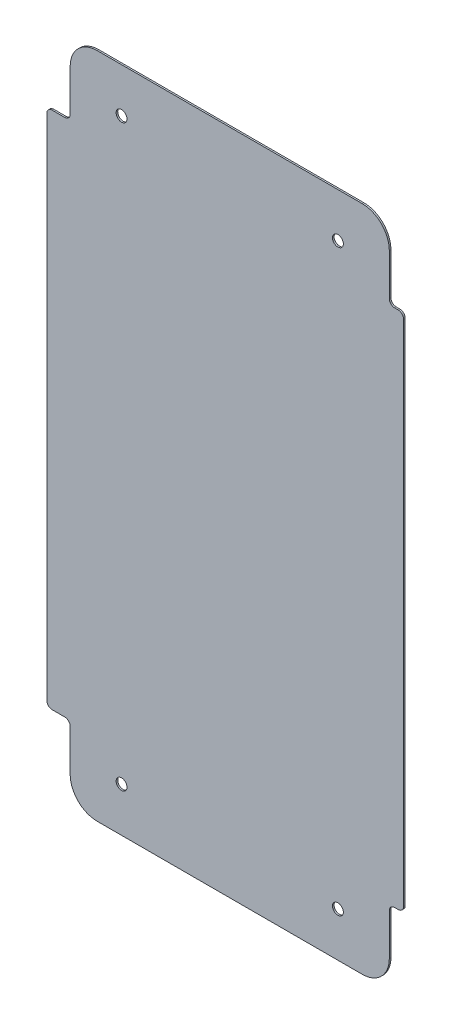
ISO-10303-21;
HEADER;
FILE_DESCRIPTION(('STEP AP214'),'2;1');
FILE_NAME('part.step','',(''),(''),'','','');
FILE_SCHEMA(('AUTOMOTIVE_DESIGN { 1 0 10303 214 1 1 1 1 }'));
ENDSEC;
DATA;
#1=APPLICATION_CONTEXT('core data for automotive mechanical design processes');
#2=APPLICATION_PROTOCOL_DEFINITION('international standard','automotive_design',2000,#1);
#3=PRODUCT_CONTEXT('',#1,'mechanical');
#4=PRODUCT('Part','Part','',(#3));
#5=PRODUCT_RELATED_PRODUCT_CATEGORY('part','',(#4));
#6=PRODUCT_DEFINITION_FORMATION('','',#4);
#7=PRODUCT_DEFINITION_CONTEXT('part definition',#1,'design');
#8=PRODUCT_DEFINITION('design','',#6,#7);
#9=PRODUCT_DEFINITION_SHAPE('','',#8);
#10=(LENGTH_UNIT() NAMED_UNIT(*) SI_UNIT(.MILLI.,.METRE.));
#11=(NAMED_UNIT(*) PLANE_ANGLE_UNIT() SI_UNIT($,.RADIAN.));
#12=(NAMED_UNIT(*) SI_UNIT($,.STERADIAN.) SOLID_ANGLE_UNIT());
#13=UNCERTAINTY_MEASURE_WITH_UNIT(LENGTH_MEASURE(1.E-05),#10,'distance_accuracy_value','');
#14=(GEOMETRIC_REPRESENTATION_CONTEXT(3) GLOBAL_UNCERTAINTY_ASSIGNED_CONTEXT((#13)) GLOBAL_UNIT_ASSIGNED_CONTEXT((#10,
#11,#12)) REPRESENTATION_CONTEXT('',''));
#15=CARTESIAN_POINT('',(0.,0.,0.));
#16=DIRECTION('',(0.,0.,1.));
#17=DIRECTION('',(1.,0.,0.));
#18=AXIS2_PLACEMENT_3D('',#15,#16,#17);
#19=CARTESIAN_POINT('',(81.661,121.92,0.762));
#20=DIRECTION('',(-1.,0.,0.));
#21=DIRECTION('',(0.,0.,1.));
#22=AXIS2_PLACEMENT_3D('',#19,#20,#21);
#23=PLANE('',#22);
#24=DIRECTION('',(0.,1.,0.));
#25=VECTOR('',#24,1.);
#26=CARTESIAN_POINT('',(81.661,121.92,0.762));
#27=LINE('',#26,#25);
#28=CARTESIAN_POINT('',(81.661,-119.38,0.762));
#29=VERTEX_POINT('',#28);
#30=CARTESIAN_POINT('',(81.661,119.38,0.762));
#31=VERTEX_POINT('',#30);
#32=EDGE_CURVE('E289',#29,#31,#27,.T.);
#33=ORIENTED_EDGE('',*,*,#32,.F.);
#34=DIRECTION('',(0.,0.,-1.));
#35=VECTOR('',#34,1.);
#36=CARTESIAN_POINT('',(81.661,-119.38,0.762));
#37=LINE('',#36,#35);
#38=CARTESIAN_POINT('',(81.661,-119.38,0.));
#39=VERTEX_POINT('',#38);
#40=EDGE_CURVE('E345',#29,#39,#37,.T.);
#41=ORIENTED_EDGE('',*,*,#40,.T.);
#42=DIRECTION('',(0.,1.,0.));
#43=VECTOR('',#42,1.);
#44=CARTESIAN_POINT('',(81.661,121.92,0.));
#45=LINE('',#44,#43);
#46=CARTESIAN_POINT('',(81.661,119.38,0.));
#47=VERTEX_POINT('',#46);
#48=EDGE_CURVE('E250',#39,#47,#45,.T.);
#49=ORIENTED_EDGE('',*,*,#48,.T.);
#50=DIRECTION('',(0.,0.,-1.));
#51=VECTOR('',#50,1.);
#52=CARTESIAN_POINT('',(81.661,119.38,0.762));
#53=LINE('',#52,#51);
#54=EDGE_CURVE('E343',#47,#31,#53,.F.);
#55=ORIENTED_EDGE('',*,*,#54,.T.);
#56=EDGE_LOOP('',(#33,#41,#49,#55));
#57=FACE_BOUND('',#56,.T.);
#58=ADVANCED_FACE('F32',(#57),#23,.F.);
#59=CARTESIAN_POINT('',(81.661,121.92,0.762));
#60=DIRECTION('',(0.,-1.,0.));
#61=DIRECTION('',(0.,0.,-1.));
#62=AXIS2_PLACEMENT_3D('',#59,#60,#61);
#63=PLANE('',#62);
#64=DIRECTION('',(-1.,0.,0.));
#65=VECTOR('',#64,1.);
#66=CARTESIAN_POINT('',(81.661,121.92,0.762));
#67=LINE('',#66,#65);
#68=CARTESIAN_POINT('',(79.121,121.92,0.762));
#69=VERTEX_POINT('',#68);
#70=CARTESIAN_POINT('',(77.4700000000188,121.92,0.762));
#71=VERTEX_POINT('',#70);
#72=EDGE_CURVE('E204',#69,#71,#67,.T.);
#73=ORIENTED_EDGE('',*,*,#72,.F.);
#74=DIRECTION('',(0.,0.,-1.));
#75=VECTOR('',#74,1.);
#76=CARTESIAN_POINT('',(79.121,121.92,0.762));
#77=LINE('',#76,#75);
#78=CARTESIAN_POINT('',(79.121,121.92,0.));
#79=VERTEX_POINT('',#78);
#80=EDGE_CURVE('E356',#69,#79,#77,.T.);
#81=ORIENTED_EDGE('',*,*,#80,.T.);
#82=DIRECTION('',(-1.,0.,0.));
#83=VECTOR('',#82,1.);
#84=CARTESIAN_POINT('',(81.661,121.92,0.));
#85=LINE('',#84,#83);
#86=CARTESIAN_POINT('',(77.4700000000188,121.92,0.));
#87=VERTEX_POINT('',#86);
#88=EDGE_CURVE('E253',#79,#87,#85,.T.);
#89=ORIENTED_EDGE('',*,*,#88,.T.);
#90=DIRECTION('',(0.,0.,-1.));
#91=VECTOR('',#90,1.);
#92=CARTESIAN_POINT('',(77.4700000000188,121.92,0.762));
#93=LINE('',#92,#91);
#94=EDGE_CURVE('E354',#87,#71,#93,.F.);
#95=ORIENTED_EDGE('',*,*,#94,.T.);
#96=EDGE_LOOP('',(#73,#81,#89,#95));
#97=FACE_BOUND('',#96,.T.);
#98=ADVANCED_FACE('F379',(#97),#63,.F.);
#99=CARTESIAN_POINT('',(74.9300000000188,144.018,0.762));
#100=DIRECTION('',(-1.,0.,0.));
#101=DIRECTION('',(0.,0.,1.));
#102=AXIS2_PLACEMENT_3D('',#99,#100,#101);
#103=PLANE('',#102);
#104=DIRECTION('',(0.,1.,0.));
#105=VECTOR('',#104,1.);
#106=CARTESIAN_POINT('',(74.9300000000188,144.018,0.762));
#107=LINE('',#106,#105);
#108=CARTESIAN_POINT('',(74.9300000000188,124.46,0.762));
#109=VERTEX_POINT('',#108);
#110=CARTESIAN_POINT('',(74.9300000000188,144.018,0.762));
#111=VERTEX_POINT('',#110);
#112=EDGE_CURVE('E192',#109,#111,#107,.T.);
#113=ORIENTED_EDGE('',*,*,#112,.F.);
#114=DIRECTION('',(0.,0.,-1.));
#115=VECTOR('',#114,1.);
#116=CARTESIAN_POINT('',(74.9300000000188,124.46,0.));
#117=LINE('',#116,#115);
#118=CARTESIAN_POINT('',(74.9300000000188,124.46,0.));
#119=VERTEX_POINT('',#118);
#120=EDGE_CURVE('E359',#109,#119,#117,.T.);
#121=ORIENTED_EDGE('',*,*,#120,.T.);
#122=DIRECTION('',(0.,1.,0.));
#123=VECTOR('',#122,1.);
#124=CARTESIAN_POINT('',(74.9300000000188,144.018,0.));
#125=LINE('',#124,#123);
#126=CARTESIAN_POINT('',(74.9300000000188,144.018,0.));
#127=VERTEX_POINT('',#126);
#128=EDGE_CURVE('E210',#119,#127,#125,.T.);
#129=ORIENTED_EDGE('',*,*,#128,.T.);
#130=DIRECTION('',(0.,0.,-1.));
#131=VECTOR('',#130,1.);
#132=CARTESIAN_POINT('',(74.9300000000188,144.018,0.762));
#133=LINE('',#132,#131);
#134=EDGE_CURVE('E207',#111,#127,#133,.T.);
#135=ORIENTED_EDGE('',*,*,#134,.F.);
#136=EDGE_LOOP('',(#113,#121,#129,#135));
#137=FACE_BOUND('',#136,.T.);
#138=ADVANCED_FACE('F208',(#137),#103,.F.);
#139=CARTESIAN_POINT('',(62.2300000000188,144.018,0.762));
#140=DIRECTION('',(0.,0.,-1.));
#141=DIRECTION('',(-1.,0.,0.));
#142=AXIS2_PLACEMENT_3D('',#139,#140,#141);
#143=CYLINDRICAL_SURFACE('',#142,12.7);
#144=CARTESIAN_POINT('',(62.2300000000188,144.018,0.));
#145=DIRECTION('',(0.,0.,1.));
#146=DIRECTION('',(-1.,0.,0.));
#147=AXIS2_PLACEMENT_3D('',#144,#145,#146);
#148=CIRCLE('',#147,12.7);
#149=CARTESIAN_POINT('',(62.2300000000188,156.718,0.));
#150=VERTEX_POINT('',#149);
#151=EDGE_CURVE('E258',#127,#150,#148,.T.);
#152=ORIENTED_EDGE('',*,*,#151,.T.);
#153=DIRECTION('',(0.,0.,-1.));
#154=VECTOR('',#153,1.);
#155=CARTESIAN_POINT('',(62.2300000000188,156.718,0.762));
#156=LINE('',#155,#154);
#157=CARTESIAN_POINT('',(62.2300000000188,156.718,0.762));
#158=VERTEX_POINT('',#157);
#159=EDGE_CURVE('E214',#158,#150,#156,.T.);
#160=ORIENTED_EDGE('',*,*,#159,.F.);
#161=CARTESIAN_POINT('',(62.2300000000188,144.018,0.762));
#162=DIRECTION('',(0.,0.,1.));
#163=DIRECTION('',(-1.,0.,0.));
#164=AXIS2_PLACEMENT_3D('',#161,#162,#163);
#165=CIRCLE('',#164,12.7);
#166=EDGE_CURVE('E197',#111,#158,#165,.T.);
#167=ORIENTED_EDGE('',*,*,#166,.F.);
#168=ORIENTED_EDGE('',*,*,#134,.T.);
#169=EDGE_LOOP('',(#152,#160,#167,#168));
#170=FACE_BOUND('',#169,.T.);
#171=ADVANCED_FACE('F216',(#170),#143,.T.);
#172=CARTESIAN_POINT('',(-62.2299999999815,156.718,0.762));
#173=DIRECTION('',(0.,-1.,0.));
#174=DIRECTION('',(0.,0.,-1.));
#175=AXIS2_PLACEMENT_3D('',#172,#173,#174);
#176=PLANE('',#175);
#177=DIRECTION('',(-1.,0.,0.));
#178=VECTOR('',#177,1.);
#179=CARTESIAN_POINT('',(-62.2299999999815,156.718,0.));
#180=LINE('',#179,#178);
#181=CARTESIAN_POINT('',(-62.2299999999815,156.718,0.));
#182=VERTEX_POINT('',#181);
#183=EDGE_CURVE('E260',#150,#182,#180,.T.);
#184=ORIENTED_EDGE('',*,*,#183,.T.);
#185=DIRECTION('',(0.,0.,-1.));
#186=VECTOR('',#185,1.);
#187=CARTESIAN_POINT('',(-62.2299999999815,156.718,0.762));
#188=LINE('',#187,#186);
#189=CARTESIAN_POINT('',(-62.2299999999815,156.718,0.762));
#190=VERTEX_POINT('',#189);
#191=EDGE_CURVE('E304',#190,#182,#188,.T.);
#192=ORIENTED_EDGE('',*,*,#191,.F.);
#193=DIRECTION('',(-1.,0.,0.));
#194=VECTOR('',#193,1.);
#195=CARTESIAN_POINT('',(-62.2299999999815,156.718,0.762));
#196=LINE('',#195,#194);
#197=EDGE_CURVE('E219',#158,#190,#196,.T.);
#198=ORIENTED_EDGE('',*,*,#197,.F.);
#199=ORIENTED_EDGE('',*,*,#159,.T.);
#200=EDGE_LOOP('',(#184,#192,#198,#199));
#201=FACE_BOUND('',#200,.T.);
#202=ADVANCED_FACE('F528',(#201),#176,.F.);
#203=CARTESIAN_POINT('',(-62.2299999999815,144.018,0.762));
#204=DIRECTION('',(0.,0.,-1.));
#205=DIRECTION('',(-1.,0.,0.));
#206=AXIS2_PLACEMENT_3D('',#203,#204,#205);
#207=CYLINDRICAL_SURFACE('',#206,12.7);
#208=CARTESIAN_POINT('',(-62.2299999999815,144.018,0.));
#209=DIRECTION('',(0.,0.,1.));
#210=DIRECTION('',(-1.,0.,0.));
#211=AXIS2_PLACEMENT_3D('',#208,#209,#210);
#212=CIRCLE('',#211,12.7);
#213=CARTESIAN_POINT('',(-74.9299999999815,144.018,0.));
#214=VERTEX_POINT('',#213);
#215=EDGE_CURVE('E262',#182,#214,#212,.T.);
#216=ORIENTED_EDGE('',*,*,#215,.T.);
#217=DIRECTION('',(0.,0.,-1.));
#218=VECTOR('',#217,1.);
#219=CARTESIAN_POINT('',(-74.9299999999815,144.018,0.762));
#220=LINE('',#219,#218);
#221=CARTESIAN_POINT('',(-74.9299999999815,144.018,0.762));
#222=VERTEX_POINT('',#221);
#223=EDGE_CURVE('E301',#222,#214,#220,.T.);
#224=ORIENTED_EDGE('',*,*,#223,.F.);
#225=CARTESIAN_POINT('',(-62.2299999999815,144.018,0.762));
#226=DIRECTION('',(0.,0.,1.));
#227=DIRECTION('',(-1.,0.,0.));
#228=AXIS2_PLACEMENT_3D('',#225,#226,#227);
#229=CIRCLE('',#228,12.7);
#230=EDGE_CURVE('E221',#190,#222,#229,.T.);
#231=ORIENTED_EDGE('',*,*,#230,.F.);
#232=ORIENTED_EDGE('',*,*,#191,.T.);
#233=EDGE_LOOP('',(#216,#224,#231,#232));
#234=FACE_BOUND('',#233,.T.);
#235=ADVANCED_FACE('F524',(#234),#207,.T.);
#236=CARTESIAN_POINT('',(-74.9299999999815,144.018,0.762));
#237=DIRECTION('',(1.,0.,0.));
#238=DIRECTION('',(0.,0.,-1.));
#239=AXIS2_PLACEMENT_3D('',#236,#237,#238);
#240=PLANE('',#239);
#241=DIRECTION('',(0.,-1.,0.));
#242=VECTOR('',#241,1.);
#243=CARTESIAN_POINT('',(-74.9299999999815,144.018,0.));
#244=LINE('',#243,#242);
#245=CARTESIAN_POINT('',(-74.9299999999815,124.46,0.));
#246=VERTEX_POINT('',#245);
#247=EDGE_CURVE('E264',#214,#246,#244,.T.);
#248=ORIENTED_EDGE('',*,*,#247,.T.);
#249=DIRECTION('',(0.,0.,-1.));
#250=VECTOR('',#249,1.);
#251=CARTESIAN_POINT('',(-74.9299999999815,124.46,0.762));
#252=LINE('',#251,#250);
#253=CARTESIAN_POINT('',(-74.9299999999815,124.46,0.762));
#254=VERTEX_POINT('',#253);
#255=EDGE_CURVE('E333',#246,#254,#252,.F.);
#256=ORIENTED_EDGE('',*,*,#255,.T.);
#257=DIRECTION('',(0.,-1.,0.));
#258=VECTOR('',#257,1.);
#259=CARTESIAN_POINT('',(-74.9299999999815,144.018,0.762));
#260=LINE('',#259,#258);
#261=EDGE_CURVE('E226',#222,#254,#260,.T.);
#262=ORIENTED_EDGE('',*,*,#261,.F.);
#263=ORIENTED_EDGE('',*,*,#223,.T.);
#264=EDGE_LOOP('',(#248,#256,#262,#263));
#265=FACE_BOUND('',#264,.T.);
#266=ADVANCED_FACE('F520',(#265),#240,.F.);
#267=CARTESIAN_POINT('',(-74.9299999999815,121.92,0.762));
#268=DIRECTION('',(0.,-1.,0.));
#269=DIRECTION('',(1.,0.,0.));
#270=AXIS2_PLACEMENT_3D('',#267,#268,#269);
#271=PLANE('',#270);
#272=DIRECTION('',(-1.,0.,0.));
#273=VECTOR('',#272,1.);
#274=CARTESIAN_POINT('',(-74.9299999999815,121.92,0.));
#275=LINE('',#274,#273);
#276=CARTESIAN_POINT('',(-77.4699999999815,121.92,0.));
#277=VERTEX_POINT('',#276);
#278=CARTESIAN_POINT('',(-83.3882,121.92,0.));
#279=VERTEX_POINT('',#278);
#280=EDGE_CURVE('E267',#277,#279,#275,.T.);
#281=ORIENTED_EDGE('',*,*,#280,.T.);
#282=DIRECTION('',(0.,0.,-1.));
#283=VECTOR('',#282,1.);
#284=CARTESIAN_POINT('',(-83.3882,121.92,0.762));
#285=LINE('',#284,#283);
#286=CARTESIAN_POINT('',(-83.3882,121.92,0.762));
#287=VERTEX_POINT('',#286);
#288=EDGE_CURVE('E323',#279,#287,#285,.F.);
#289=ORIENTED_EDGE('',*,*,#288,.T.);
#290=DIRECTION('',(-1.,0.,0.));
#291=VECTOR('',#290,1.);
#292=CARTESIAN_POINT('',(-74.9299999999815,121.92,0.762));
#293=LINE('',#292,#291);
#294=CARTESIAN_POINT('',(-77.4699999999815,121.92,0.762));
#295=VERTEX_POINT('',#294);
#296=EDGE_CURVE('E229',#295,#287,#293,.T.);
#297=ORIENTED_EDGE('',*,*,#296,.F.);
#298=DIRECTION('',(0.,0.,-1.));
#299=VECTOR('',#298,1.);
#300=CARTESIAN_POINT('',(-77.4699999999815,121.92,0.));
#301=LINE('',#300,#299);
#302=EDGE_CURVE('E320',#295,#277,#301,.T.);
#303=ORIENTED_EDGE('',*,*,#302,.T.);
#304=EDGE_LOOP('',(#281,#289,#297,#303));
#305=FACE_BOUND('',#304,.T.);
#306=ADVANCED_FACE('F516',(#305),#271,.F.);
#307=CARTESIAN_POINT('',(-85.9282,121.92,0.762));
#308=DIRECTION('',(1.,0.,0.));
#309=DIRECTION('',(0.,0.,-1.));
#310=AXIS2_PLACEMENT_3D('',#307,#308,#309);
#311=PLANE('',#310);
#312=DIRECTION('',(0.,-1.,0.));
#313=VECTOR('',#312,1.);
#314=CARTESIAN_POINT('',(-85.9282,121.92,0.762));
#315=LINE('',#314,#313);
#316=CARTESIAN_POINT('',(-85.9282,119.38,0.762));
#317=VERTEX_POINT('',#316);
#318=CARTESIAN_POINT('',(-85.9282,-119.38,0.762));
#319=VERTEX_POINT('',#318);
#320=EDGE_CURVE('E231',#317,#319,#315,.T.);
#321=ORIENTED_EDGE('',*,*,#320,.F.);
#322=DIRECTION('',(0.,0.,-1.));
#323=VECTOR('',#322,1.);
#324=CARTESIAN_POINT('',(-85.9282,119.38,0.762));
#325=LINE('',#324,#323);
#326=CARTESIAN_POINT('',(-85.9282,119.38,0.));
#327=VERTEX_POINT('',#326);
#328=EDGE_CURVE('E309',#317,#327,#325,.T.);
#329=ORIENTED_EDGE('',*,*,#328,.T.);
#330=DIRECTION('',(0.,-1.,0.));
#331=VECTOR('',#330,1.);
#332=CARTESIAN_POINT('',(-85.9282,121.92,0.));
#333=LINE('',#332,#331);
#334=CARTESIAN_POINT('',(-85.9282,-119.38,0.));
#335=VERTEX_POINT('',#334);
#336=EDGE_CURVE('E270',#327,#335,#333,.T.);
#337=ORIENTED_EDGE('',*,*,#336,.T.);
#338=DIRECTION('',(0.,0.,-1.));
#339=VECTOR('',#338,1.);
#340=CARTESIAN_POINT('',(-85.9282,-119.38,0.762));
#341=LINE('',#340,#339);
#342=EDGE_CURVE('E213',#335,#319,#341,.F.);
#343=ORIENTED_EDGE('',*,*,#342,.T.);
#344=EDGE_LOOP('',(#321,#329,#337,#343));
#345=FACE_BOUND('',#344,.T.);
#346=ADVANCED_FACE('F512',(#345),#311,.F.);
#347=CARTESIAN_POINT('',(-74.9299999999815,-121.92,0.762));
#348=DIRECTION('',(0.,1.,0.));
#349=DIRECTION('',(0.,0.,1.));
#350=AXIS2_PLACEMENT_3D('',#347,#348,#349);
#351=PLANE('',#350);
#352=DIRECTION('',(1.,0.,0.));
#353=VECTOR('',#352,1.);
#354=CARTESIAN_POINT('',(-74.9299999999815,-121.92,0.762));
#355=LINE('',#354,#353);
#356=CARTESIAN_POINT('',(-83.3882,-121.92,0.762));
#357=VERTEX_POINT('',#356);
#358=CARTESIAN_POINT('',(-77.4699999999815,-121.92,0.762));
#359=VERTEX_POINT('',#358);
#360=EDGE_CURVE('E234',#357,#359,#355,.T.);
#361=ORIENTED_EDGE('',*,*,#360,.F.);
#362=DIRECTION('',(0.,0.,-1.));
#363=VECTOR('',#362,1.);
#364=CARTESIAN_POINT('',(-83.3882,-121.92,0.762));
#365=LINE('',#364,#363);
#366=CARTESIAN_POINT('',(-83.3882,-121.92,0.));
#367=VERTEX_POINT('',#366);
#368=EDGE_CURVE('E337',#357,#367,#365,.T.);
#369=ORIENTED_EDGE('',*,*,#368,.T.);
#370=DIRECTION('',(1.,0.,0.));
#371=VECTOR('',#370,1.);
#372=CARTESIAN_POINT('',(-74.9299999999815,-121.92,0.));
#373=LINE('',#372,#371);
#374=CARTESIAN_POINT('',(-77.4699999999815,-121.92,0.));
#375=VERTEX_POINT('',#374);
#376=EDGE_CURVE('E273',#367,#375,#373,.T.);
#377=ORIENTED_EDGE('',*,*,#376,.T.);
#378=DIRECTION('',(0.,0.,-1.));
#379=VECTOR('',#378,1.);
#380=CARTESIAN_POINT('',(-77.4699999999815,-121.92,0.762));
#381=LINE('',#380,#379);
#382=EDGE_CURVE('E335',#375,#359,#381,.F.);
#383=ORIENTED_EDGE('',*,*,#382,.T.);
#384=EDGE_LOOP('',(#361,#369,#377,#383));
#385=FACE_BOUND('',#384,.T.);
#386=ADVANCED_FACE('F508',(#385),#351,.F.);
#387=CARTESIAN_POINT('',(-74.9299999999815,-121.92,0.762));
#388=DIRECTION('',(1.,0.,0.));
#389=DIRECTION('',(0.,0.,-1.));
#390=AXIS2_PLACEMENT_3D('',#387,#388,#389);
#391=PLANE('',#390);
#392=DIRECTION('',(0.,-1.,0.));
#393=VECTOR('',#392,1.);
#394=CARTESIAN_POINT('',(-74.9299999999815,-121.92,0.762));
#395=LINE('',#394,#393);
#396=CARTESIAN_POINT('',(-74.9299999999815,-124.46,0.762));
#397=VERTEX_POINT('',#396);
#398=CARTESIAN_POINT('',(-74.9299999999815,-144.018,0.762));
#399=VERTEX_POINT('',#398);
#400=EDGE_CURVE('E237',#397,#399,#395,.T.);
#401=ORIENTED_EDGE('',*,*,#400,.F.);
#402=DIRECTION('',(0.,0.,-1.));
#403=VECTOR('',#402,1.);
#404=CARTESIAN_POINT('',(-74.9299999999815,-124.46,0.));
#405=LINE('',#404,#403);
#406=CARTESIAN_POINT('',(-74.9299999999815,-124.46,0.));
#407=VERTEX_POINT('',#406);
#408=EDGE_CURVE('E340',#397,#407,#405,.T.);
#409=ORIENTED_EDGE('',*,*,#408,.T.);
#410=DIRECTION('',(0.,-1.,0.));
#411=VECTOR('',#410,1.);
#412=CARTESIAN_POINT('',(-74.9299999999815,-121.92,0.));
#413=LINE('',#412,#411);
#414=CARTESIAN_POINT('',(-74.9299999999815,-144.018,0.));
#415=VERTEX_POINT('',#414);
#416=EDGE_CURVE('E276',#407,#415,#413,.T.);
#417=ORIENTED_EDGE('',*,*,#416,.T.);
#418=DIRECTION('',(0.,0.,-1.));
#419=VECTOR('',#418,1.);
#420=CARTESIAN_POINT('',(-74.9299999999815,-144.018,0.762));
#421=LINE('',#420,#419);
#422=EDGE_CURVE('E298',#399,#415,#421,.T.);
#423=ORIENTED_EDGE('',*,*,#422,.F.);
#424=EDGE_LOOP('',(#401,#409,#417,#423));
#425=FACE_BOUND('',#424,.T.);
#426=ADVANCED_FACE('F504',(#425),#391,.F.);
#427=CARTESIAN_POINT('',(-62.2299999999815,-144.018,0.762));
#428=DIRECTION('',(0.,0.,-1.));
#429=DIRECTION('',(-1.,0.,0.));
#430=AXIS2_PLACEMENT_3D('',#427,#428,#429);
#431=CYLINDRICAL_SURFACE('',#430,12.7);
#432=CARTESIAN_POINT('',(-62.2299999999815,-144.018,0.));
#433=DIRECTION('',(0.,0.,1.));
#434=DIRECTION('',(1.,0.,0.));
#435=AXIS2_PLACEMENT_3D('',#432,#433,#434);
#436=CIRCLE('',#435,12.7);
#437=CARTESIAN_POINT('',(-62.2299999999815,-156.718,0.));
#438=VERTEX_POINT('',#437);
#439=EDGE_CURVE('E278',#415,#438,#436,.T.);
#440=ORIENTED_EDGE('',*,*,#439,.T.);
#441=DIRECTION('',(0.,0.,-1.));
#442=VECTOR('',#441,1.);
#443=CARTESIAN_POINT('',(-62.2299999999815,-156.718,0.762));
#444=LINE('',#443,#442);
#445=CARTESIAN_POINT('',(-62.2299999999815,-156.718,0.762));
#446=VERTEX_POINT('',#445);
#447=EDGE_CURVE('E295',#446,#438,#444,.T.);
#448=ORIENTED_EDGE('',*,*,#447,.F.);
#449=CARTESIAN_POINT('',(-62.2299999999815,-144.018,0.762));
#450=DIRECTION('',(0.,0.,1.));
#451=DIRECTION('',(1.,0.,0.));
#452=AXIS2_PLACEMENT_3D('',#449,#450,#451);
#453=CIRCLE('',#452,12.7);
#454=EDGE_CURVE('E239',#399,#446,#453,.T.);
#455=ORIENTED_EDGE('',*,*,#454,.F.);
#456=ORIENTED_EDGE('',*,*,#422,.T.);
#457=EDGE_LOOP('',(#440,#448,#455,#456));
#458=FACE_BOUND('',#457,.T.);
#459=ADVANCED_FACE('F500',(#458),#431,.T.);
#460=CARTESIAN_POINT('',(-62.2299999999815,-156.718,0.762));
#461=DIRECTION('',(0.,1.,0.));
#462=DIRECTION('',(0.,0.,1.));
#463=AXIS2_PLACEMENT_3D('',#460,#461,#462);
#464=PLANE('',#463);
#465=DIRECTION('',(1.,0.,0.));
#466=VECTOR('',#465,1.);
#467=CARTESIAN_POINT('',(-62.2299999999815,-156.718,0.));
#468=LINE('',#467,#466);
#469=CARTESIAN_POINT('',(62.2300000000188,-156.718,0.));
#470=VERTEX_POINT('',#469);
#471=EDGE_CURVE('E280',#438,#470,#468,.T.);
#472=ORIENTED_EDGE('',*,*,#471,.T.);
#473=DIRECTION('',(0.,0.,-1.));
#474=VECTOR('',#473,1.);
#475=CARTESIAN_POINT('',(62.2300000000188,-156.718,0.762));
#476=LINE('',#475,#474);
#477=CARTESIAN_POINT('',(62.2300000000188,-156.718,0.762));
#478=VERTEX_POINT('',#477);
#479=EDGE_CURVE('E292',#478,#470,#476,.T.);
#480=ORIENTED_EDGE('',*,*,#479,.F.);
#481=DIRECTION('',(1.,0.,0.));
#482=VECTOR('',#481,1.);
#483=CARTESIAN_POINT('',(-62.2299999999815,-156.718,0.762));
#484=LINE('',#483,#482);
#485=EDGE_CURVE('E241',#446,#478,#484,.T.);
#486=ORIENTED_EDGE('',*,*,#485,.F.);
#487=ORIENTED_EDGE('',*,*,#447,.T.);
#488=EDGE_LOOP('',(#472,#480,#486,#487));
#489=FACE_BOUND('',#488,.T.);
#490=ADVANCED_FACE('F496',(#489),#464,.F.);
#491=CARTESIAN_POINT('',(62.2300000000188,-144.018,0.762));
#492=DIRECTION('',(0.,0.,-1.));
#493=DIRECTION('',(-1.,0.,0.));
#494=AXIS2_PLACEMENT_3D('',#491,#492,#493);
#495=CYLINDRICAL_SURFACE('',#494,12.7);
#496=CARTESIAN_POINT('',(62.2300000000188,-144.018,0.));
#497=DIRECTION('',(0.,0.,1.));
#498=DIRECTION('',(1.,0.,0.));
#499=AXIS2_PLACEMENT_3D('',#496,#497,#498);
#500=CIRCLE('',#499,12.7);
#501=CARTESIAN_POINT('',(74.9300000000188,-144.018,0.));
#502=VERTEX_POINT('',#501);
#503=EDGE_CURVE('E282',#470,#502,#500,.T.);
#504=ORIENTED_EDGE('',*,*,#503,.T.);
#505=DIRECTION('',(0.,0.,-1.));
#506=VECTOR('',#505,1.);
#507=CARTESIAN_POINT('',(74.9300000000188,-144.018,0.762));
#508=LINE('',#507,#506);
#509=CARTESIAN_POINT('',(74.9300000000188,-144.018,0.762));
#510=VERTEX_POINT('',#509);
#511=EDGE_CURVE('E249',#510,#502,#508,.T.);
#512=ORIENTED_EDGE('',*,*,#511,.F.);
#513=CARTESIAN_POINT('',(62.2300000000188,-144.018,0.762));
#514=DIRECTION('',(0.,0.,1.));
#515=DIRECTION('',(1.,0.,0.));
#516=AXIS2_PLACEMENT_3D('',#513,#514,#515);
#517=CIRCLE('',#516,12.7);
#518=EDGE_CURVE('E243',#478,#510,#517,.T.);
#519=ORIENTED_EDGE('',*,*,#518,.F.);
#520=ORIENTED_EDGE('',*,*,#479,.T.);
#521=EDGE_LOOP('',(#504,#512,#519,#520));
#522=FACE_BOUND('',#521,.T.);
#523=ADVANCED_FACE('F492',(#522),#495,.T.);
#524=CARTESIAN_POINT('',(74.9300000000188,-121.92,0.762));
#525=DIRECTION('',(-1.,0.,0.));
#526=DIRECTION('',(0.,0.,1.));
#527=AXIS2_PLACEMENT_3D('',#524,#525,#526);
#528=PLANE('',#527);
#529=DIRECTION('',(0.,1.,0.));
#530=VECTOR('',#529,1.);
#531=CARTESIAN_POINT('',(74.9300000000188,-121.92,0.));
#532=LINE('',#531,#530);
#533=CARTESIAN_POINT('',(74.9300000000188,-124.46,0.));
#534=VERTEX_POINT('',#533);
#535=EDGE_CURVE('E284',#502,#534,#532,.T.);
#536=ORIENTED_EDGE('',*,*,#535,.T.);
#537=DIRECTION('',(0.,0.,-1.));
#538=VECTOR('',#537,1.);
#539=CARTESIAN_POINT('',(74.9300000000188,-124.46,0.762));
#540=LINE('',#539,#538);
#541=CARTESIAN_POINT('',(74.9300000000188,-124.46,0.762));
#542=VERTEX_POINT('',#541);
#543=EDGE_CURVE('E352',#534,#542,#540,.F.);
#544=ORIENTED_EDGE('',*,*,#543,.T.);
#545=DIRECTION('',(0.,1.,0.));
#546=VECTOR('',#545,1.);
#547=CARTESIAN_POINT('',(74.9300000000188,-121.92,0.762));
#548=LINE('',#547,#546);
#549=EDGE_CURVE('E245',#510,#542,#548,.T.);
#550=ORIENTED_EDGE('',*,*,#549,.F.);
#551=ORIENTED_EDGE('',*,*,#511,.T.);
#552=EDGE_LOOP('',(#536,#544,#550,#551));
#553=FACE_BOUND('',#552,.T.);
#554=ADVANCED_FACE('F489',(#553),#528,.F.);
#555=CARTESIAN_POINT('',(81.661,-121.92,0.762));
#556=DIRECTION('',(0.,1.,0.));
#557=DIRECTION('',(0.,0.,1.));
#558=AXIS2_PLACEMENT_3D('',#555,#556,#557);
#559=PLANE('',#558);
#560=DIRECTION('',(1.,0.,0.));
#561=VECTOR('',#560,1.);
#562=CARTESIAN_POINT('',(81.661,-121.92,0.));
#563=LINE('',#562,#561);
#564=CARTESIAN_POINT('',(77.4700000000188,-121.92,0.));
#565=VERTEX_POINT('',#564);
#566=CARTESIAN_POINT('',(79.121,-121.92,0.));
#567=VERTEX_POINT('',#566);
#568=EDGE_CURVE('E287',#565,#567,#563,.T.);
#569=ORIENTED_EDGE('',*,*,#568,.T.);
#570=DIRECTION('',(0.,0.,-1.));
#571=VECTOR('',#570,1.);
#572=CARTESIAN_POINT('',(79.121,-121.92,0.762));
#573=LINE('',#572,#571);
#574=CARTESIAN_POINT('',(79.121,-121.92,0.762));
#575=VERTEX_POINT('',#574);
#576=EDGE_CURVE('E47',#567,#575,#573,.F.);
#577=ORIENTED_EDGE('',*,*,#576,.T.);
#578=DIRECTION('',(1.,0.,0.));
#579=VECTOR('',#578,1.);
#580=CARTESIAN_POINT('',(81.661,-121.92,0.762));
#581=LINE('',#580,#579);
#582=CARTESIAN_POINT('',(77.4700000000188,-121.92,0.762));
#583=VERTEX_POINT('',#582);
#584=EDGE_CURVE('E247',#583,#575,#581,.T.);
#585=ORIENTED_EDGE('',*,*,#584,.F.);
#586=DIRECTION('',(0.,0.,-1.));
#587=VECTOR('',#586,1.);
#588=CARTESIAN_POINT('',(77.4700000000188,-121.92,0.));
#589=LINE('',#588,#587);
#590=EDGE_CURVE('E348',#583,#565,#589,.T.);
#591=ORIENTED_EDGE('',*,*,#590,.T.);
#592=EDGE_LOOP('',(#569,#577,#585,#591));
#593=FACE_BOUND('',#592,.T.);
#594=ADVANCED_FACE('F426',(#593),#559,.F.);
#595=CARTESIAN_POINT('',(62.2300000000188,-144.018,0.762));
#596=DIRECTION('',(0.,0.,1.));
#597=DIRECTION('',(1.,0.,0.));
#598=AXIS2_PLACEMENT_3D('',#595,#596,#597);
#599=PLANE('',#598);
#600=CARTESIAN_POINT('',(50.8,135.89,0.762));
#601=DIRECTION('',(0.,0.,-1.));
#602=DIRECTION('',(-1.,0.,0.));
#603=AXIS2_PLACEMENT_3D('',#600,#601,#602);
#604=CIRCLE('',#603,2.5527);
#605=CARTESIAN_POINT('',(48.2473,135.89,0.762));
#606=VERTEX_POINT('',#605);
#607=EDGE_CURVE('E453',#606,#606,#604,.T.);
#608=ORIENTED_EDGE('',*,*,#607,.T.);
#609=EDGE_LOOP('',(#608));
#610=FACE_BOUND('',#609,.T.);
#611=CARTESIAN_POINT('',(-50.8,135.89,0.762));
#612=DIRECTION('',(0.,0.,-1.));
#613=DIRECTION('',(-1.,0.,0.));
#614=AXIS2_PLACEMENT_3D('',#611,#612,#613);
#615=CIRCLE('',#614,2.5527);
#616=CARTESIAN_POINT('',(-53.3527,135.89,0.762));
#617=VERTEX_POINT('',#616);
#618=EDGE_CURVE('E447',#617,#617,#615,.T.);
#619=ORIENTED_EDGE('',*,*,#618,.T.);
#620=EDGE_LOOP('',(#619));
#621=FACE_BOUND('',#620,.T.);
#622=CARTESIAN_POINT('',(-50.8,-135.89,0.762));
#623=DIRECTION('',(0.,0.,-1.));
#624=DIRECTION('',(-1.,0.,0.));
#625=AXIS2_PLACEMENT_3D('',#622,#623,#624);
#626=CIRCLE('',#625,2.5527);
#627=CARTESIAN_POINT('',(-53.3527,-135.89,0.762));
#628=VERTEX_POINT('',#627);
#629=EDGE_CURVE('E441',#628,#628,#626,.T.);
#630=ORIENTED_EDGE('',*,*,#629,.T.);
#631=EDGE_LOOP('',(#630));
#632=FACE_BOUND('',#631,.T.);
#633=CARTESIAN_POINT('',(50.8,-135.89,0.762));
#634=DIRECTION('',(0.,0.,-1.));
#635=DIRECTION('',(-1.,0.,0.));
#636=AXIS2_PLACEMENT_3D('',#633,#634,#635);
#637=CIRCLE('',#636,2.5527);
#638=CARTESIAN_POINT('',(48.2473,-135.89,0.762));
#639=VERTEX_POINT('',#638);
#640=EDGE_CURVE('E254',#639,#639,#637,.T.);
#641=ORIENTED_EDGE('',*,*,#640,.T.);
#642=EDGE_LOOP('',(#641));
#643=FACE_BOUND('',#642,.T.);
#644=ORIENTED_EDGE('',*,*,#296,.T.);
#645=CARTESIAN_POINT('',(-83.3882,119.38,0.762));
#646=DIRECTION('',(0.,0.,1.));
#647=DIRECTION('',(1.,0.,0.));
#648=AXIS2_PLACEMENT_3D('',#645,#646,#647);
#649=CIRCLE('',#648,2.54);
#650=EDGE_CURVE('E331',#287,#317,#649,.T.);
#651=ORIENTED_EDGE('',*,*,#650,.T.);
#652=ORIENTED_EDGE('',*,*,#320,.T.);
#653=CARTESIAN_POINT('',(-83.3882,-119.38,0.762));
#654=DIRECTION('',(0.,0.,1.));
#655=DIRECTION('',(1.,0.,0.));
#656=AXIS2_PLACEMENT_3D('',#653,#654,#655);
#657=CIRCLE('',#656,2.54);
#658=EDGE_CURVE('E329',#319,#357,#657,.T.);
#659=ORIENTED_EDGE('',*,*,#658,.T.);
#660=ORIENTED_EDGE('',*,*,#360,.T.);
#661=CARTESIAN_POINT('',(-77.4699999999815,-124.46,0.762));
#662=DIRECTION('',(0.,0.,1.));
#663=DIRECTION('',(1.,0.,0.));
#664=AXIS2_PLACEMENT_3D('',#661,#662,#663);
#665=CIRCLE('',#664,2.54);
#666=EDGE_CURVE('E367',#359,#397,#665,.F.);
#667=ORIENTED_EDGE('',*,*,#666,.T.);
#668=ORIENTED_EDGE('',*,*,#400,.T.);
#669=ORIENTED_EDGE('',*,*,#454,.T.);
#670=ORIENTED_EDGE('',*,*,#485,.T.);
#671=ORIENTED_EDGE('',*,*,#518,.T.);
#672=ORIENTED_EDGE('',*,*,#549,.T.);
#673=CARTESIAN_POINT('',(77.4700000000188,-124.46,0.762));
#674=DIRECTION('',(0.,0.,1.));
#675=DIRECTION('',(1.,0.,0.));
#676=AXIS2_PLACEMENT_3D('',#673,#674,#675);
#677=CIRCLE('',#676,2.54);
#678=EDGE_CURVE('E54',#542,#583,#677,.F.);
#679=ORIENTED_EDGE('',*,*,#678,.T.);
#680=ORIENTED_EDGE('',*,*,#584,.T.);
#681=CARTESIAN_POINT('',(79.121,-119.38,0.762));
#682=DIRECTION('',(0.,0.,1.));
#683=DIRECTION('',(1.,0.,0.));
#684=AXIS2_PLACEMENT_3D('',#681,#682,#683);
#685=CIRCLE('',#684,2.54);
#686=EDGE_CURVE('E327',#575,#29,#685,.T.);
#687=ORIENTED_EDGE('',*,*,#686,.T.);
#688=ORIENTED_EDGE('',*,*,#32,.T.);
#689=CARTESIAN_POINT('',(79.121,119.38,0.762));
#690=DIRECTION('',(0.,0.,1.));
#691=DIRECTION('',(1.,0.,0.));
#692=AXIS2_PLACEMENT_3D('',#689,#690,#691);
#693=CIRCLE('',#692,2.54);
#694=EDGE_CURVE('E325',#31,#69,#693,.T.);
#695=ORIENTED_EDGE('',*,*,#694,.T.);
#696=ORIENTED_EDGE('',*,*,#72,.T.);
#697=CARTESIAN_POINT('',(77.4700000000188,124.46,0.762));
#698=DIRECTION('',(0.,0.,1.));
#699=DIRECTION('',(1.,0.,0.));
#700=AXIS2_PLACEMENT_3D('',#697,#698,#699);
#701=CIRCLE('',#700,2.54);
#702=EDGE_CURVE('E11',#71,#109,#701,.F.);
#703=ORIENTED_EDGE('',*,*,#702,.T.);
#704=ORIENTED_EDGE('',*,*,#112,.T.);
#705=ORIENTED_EDGE('',*,*,#166,.T.);
#706=ORIENTED_EDGE('',*,*,#197,.T.);
#707=ORIENTED_EDGE('',*,*,#230,.T.);
#708=ORIENTED_EDGE('',*,*,#261,.T.);
#709=CARTESIAN_POINT('',(-77.4699999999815,124.46,0.762));
#710=DIRECTION('',(0.,0.,1.));
#711=DIRECTION('',(1.,0.,0.));
#712=AXIS2_PLACEMENT_3D('',#709,#710,#711);
#713=CIRCLE('',#712,2.54);
#714=EDGE_CURVE('E363',#254,#295,#713,.F.);
#715=ORIENTED_EDGE('',*,*,#714,.T.);
#716=EDGE_LOOP('',(#644,#651,#652,#659,#660,#667,#668,#669,#670,#671,#672,#679,#680,#687,#688,
#695,#696,#703,#704,#705,#706,#707,#708,#715));
#717=FACE_BOUND('',#716,.T.);
#718=ADVANCED_FACE('F195',(#610,#621,#632,#643,#717),#599,.T.);
#719=CARTESIAN_POINT('',(62.2300000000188,-144.018,0.));
#720=DIRECTION('',(0.,0.,1.));
#721=DIRECTION('',(1.,0.,0.));
#722=AXIS2_PLACEMENT_3D('',#719,#720,#721);
#723=PLANE('',#722);
#724=CARTESIAN_POINT('',(50.8,135.89,0.));
#725=DIRECTION('',(0.,0.,-1.));
#726=DIRECTION('',(-1.,0.,0.));
#727=AXIS2_PLACEMENT_3D('',#724,#725,#726);
#728=CIRCLE('',#727,2.55269999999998);
#729=CARTESIAN_POINT('',(48.2473,135.89,0.));
#730=VERTEX_POINT('',#729);
#731=EDGE_CURVE('E456',#730,#730,#728,.T.);
#732=ORIENTED_EDGE('',*,*,#731,.F.);
#733=EDGE_LOOP('',(#732));
#734=FACE_BOUND('',#733,.T.);
#735=CARTESIAN_POINT('',(-50.8,135.89,0.));
#736=DIRECTION('',(0.,0.,-1.));
#737=DIRECTION('',(-1.,0.,0.));
#738=AXIS2_PLACEMENT_3D('',#735,#736,#737);
#739=CIRCLE('',#738,2.55269999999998);
#740=CARTESIAN_POINT('',(-53.3527,135.89,0.));
#741=VERTEX_POINT('',#740);
#742=EDGE_CURVE('E450',#741,#741,#739,.T.);
#743=ORIENTED_EDGE('',*,*,#742,.F.);
#744=EDGE_LOOP('',(#743));
#745=FACE_BOUND('',#744,.T.);
#746=CARTESIAN_POINT('',(-50.8,-135.89,0.));
#747=DIRECTION('',(0.,0.,-1.));
#748=DIRECTION('',(-1.,0.,0.));
#749=AXIS2_PLACEMENT_3D('',#746,#747,#748);
#750=CIRCLE('',#749,2.55269999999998);
#751=CARTESIAN_POINT('',(-53.3527,-135.89,0.));
#752=VERTEX_POINT('',#751);
#753=EDGE_CURVE('E444',#752,#752,#750,.T.);
#754=ORIENTED_EDGE('',*,*,#753,.F.);
#755=EDGE_LOOP('',(#754));
#756=FACE_BOUND('',#755,.T.);
#757=CARTESIAN_POINT('',(50.8,-135.89,0.));
#758=DIRECTION('',(0.,0.,-1.));
#759=DIRECTION('',(-1.,0.,0.));
#760=AXIS2_PLACEMENT_3D('',#757,#758,#759);
#761=CIRCLE('',#760,2.55269999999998);
#762=CARTESIAN_POINT('',(48.2473,-135.89,0.));
#763=VERTEX_POINT('',#762);
#764=EDGE_CURVE('E438',#763,#763,#761,.T.);
#765=ORIENTED_EDGE('',*,*,#764,.F.);
#766=EDGE_LOOP('',(#765));
#767=FACE_BOUND('',#766,.T.);
#768=ORIENTED_EDGE('',*,*,#336,.F.);
#769=CARTESIAN_POINT('',(-83.3882,119.38,0.));
#770=DIRECTION('',(0.,0.,1.));
#771=DIRECTION('',(1.,0.,0.));
#772=AXIS2_PLACEMENT_3D('',#769,#770,#771);
#773=CIRCLE('',#772,2.54);
#774=EDGE_CURVE('E318',#327,#279,#773,.F.);
#775=ORIENTED_EDGE('',*,*,#774,.T.);
#776=ORIENTED_EDGE('',*,*,#280,.F.);
#777=CARTESIAN_POINT('',(-77.4699999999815,124.46,0.));
#778=DIRECTION('',(0.,0.,1.));
#779=DIRECTION('',(1.,0.,0.));
#780=AXIS2_PLACEMENT_3D('',#777,#778,#779);
#781=CIRCLE('',#780,2.54);
#782=EDGE_CURVE('E361',#277,#246,#781,.T.);
#783=ORIENTED_EDGE('',*,*,#782,.T.);
#784=ORIENTED_EDGE('',*,*,#247,.F.);
#785=ORIENTED_EDGE('',*,*,#215,.F.);
#786=ORIENTED_EDGE('',*,*,#183,.F.);
#787=ORIENTED_EDGE('',*,*,#151,.F.);
#788=ORIENTED_EDGE('',*,*,#128,.F.);
#789=CARTESIAN_POINT('',(77.4700000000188,124.46,0.));
#790=DIRECTION('',(0.,0.,1.));
#791=DIRECTION('',(1.,0.,0.));
#792=AXIS2_PLACEMENT_3D('',#789,#790,#791);
#793=CIRCLE('',#792,2.54);
#794=EDGE_CURVE('E40',#119,#87,#793,.T.);
#795=ORIENTED_EDGE('',*,*,#794,.T.);
#796=ORIENTED_EDGE('',*,*,#88,.F.);
#797=CARTESIAN_POINT('',(79.121,119.38,0.));
#798=DIRECTION('',(0.,0.,1.));
#799=DIRECTION('',(1.,0.,0.));
#800=AXIS2_PLACEMENT_3D('',#797,#798,#799);
#801=CIRCLE('',#800,2.54);
#802=EDGE_CURVE('E312',#79,#47,#801,.F.);
#803=ORIENTED_EDGE('',*,*,#802,.T.);
#804=ORIENTED_EDGE('',*,*,#48,.F.);
#805=CARTESIAN_POINT('',(79.121,-119.38,0.));
#806=DIRECTION('',(0.,0.,1.));
#807=DIRECTION('',(1.,0.,0.));
#808=AXIS2_PLACEMENT_3D('',#805,#806,#807);
#809=CIRCLE('',#808,2.54);
#810=EDGE_CURVE('E314',#39,#567,#809,.F.);
#811=ORIENTED_EDGE('',*,*,#810,.T.);
#812=ORIENTED_EDGE('',*,*,#568,.F.);
#813=CARTESIAN_POINT('',(77.4700000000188,-124.46,0.));
#814=DIRECTION('',(0.,0.,1.));
#815=DIRECTION('',(1.,0.,0.));
#816=AXIS2_PLACEMENT_3D('',#813,#814,#815);
#817=CIRCLE('',#816,2.54);
#818=EDGE_CURVE('E369',#565,#534,#817,.T.);
#819=ORIENTED_EDGE('',*,*,#818,.T.);
#820=ORIENTED_EDGE('',*,*,#535,.F.);
#821=ORIENTED_EDGE('',*,*,#503,.F.);
#822=ORIENTED_EDGE('',*,*,#471,.F.);
#823=ORIENTED_EDGE('',*,*,#439,.F.);
#824=ORIENTED_EDGE('',*,*,#416,.F.);
#825=CARTESIAN_POINT('',(-77.4699999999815,-124.46,0.));
#826=DIRECTION('',(0.,0.,1.));
#827=DIRECTION('',(1.,0.,0.));
#828=AXIS2_PLACEMENT_3D('',#825,#826,#827);
#829=CIRCLE('',#828,2.54);
#830=EDGE_CURVE('E365',#407,#375,#829,.T.);
#831=ORIENTED_EDGE('',*,*,#830,.T.);
#832=ORIENTED_EDGE('',*,*,#376,.F.);
#833=CARTESIAN_POINT('',(-83.3882,-119.38,0.));
#834=DIRECTION('',(0.,0.,1.));
#835=DIRECTION('',(1.,0.,0.));
#836=AXIS2_PLACEMENT_3D('',#833,#834,#835);
#837=CIRCLE('',#836,2.54);
#838=EDGE_CURVE('E316',#367,#335,#837,.F.);
#839=ORIENTED_EDGE('',*,*,#838,.T.);
#840=EDGE_LOOP('',(#768,#775,#776,#783,#784,#785,#786,#787,#788,#795,#796,#803,#804,#811,#812,
#819,#820,#821,#822,#823,#824,#831,#832,#839));
#841=FACE_BOUND('',#840,.T.);
#842=ADVANCED_FACE('F374',(#734,#745,#756,#767,#841),#723,.F.);
#843=CARTESIAN_POINT('',(50.8,-135.89,0.));
#844=DIRECTION('',(0.,0.,-1.));
#845=DIRECTION('',(-1.,0.,0.));
#846=AXIS2_PLACEMENT_3D('',#843,#844,#845);
#847=CYLINDRICAL_SURFACE('',#846,2.55269999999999);
#848=ORIENTED_EDGE('',*,*,#640,.F.);
#849=EDGE_LOOP('',(#848));
#850=FACE_BOUND('',#849,.T.);
#851=ORIENTED_EDGE('',*,*,#764,.T.);
#852=EDGE_LOOP('',(#851));
#853=FACE_BOUND('',#852,.T.);
#854=ADVANCED_FACE('F463',(#850,#853),#847,.F.);
#855=CARTESIAN_POINT('',(-50.8,-135.89,0.));
#856=DIRECTION('',(0.,0.,-1.));
#857=DIRECTION('',(-1.,0.,0.));
#858=AXIS2_PLACEMENT_3D('',#855,#856,#857);
#859=CYLINDRICAL_SURFACE('',#858,2.55269999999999);
#860=ORIENTED_EDGE('',*,*,#629,.F.);
#861=EDGE_LOOP('',(#860));
#862=FACE_BOUND('',#861,.T.);
#863=ORIENTED_EDGE('',*,*,#753,.T.);
#864=EDGE_LOOP('',(#863));
#865=FACE_BOUND('',#864,.T.);
#866=ADVANCED_FACE('F472',(#862,#865),#859,.F.);
#867=CARTESIAN_POINT('',(-50.8,135.89,0.));
#868=DIRECTION('',(0.,0.,-1.));
#869=DIRECTION('',(-1.,0.,0.));
#870=AXIS2_PLACEMENT_3D('',#867,#868,#869);
#871=CYLINDRICAL_SURFACE('',#870,2.55269999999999);
#872=ORIENTED_EDGE('',*,*,#618,.F.);
#873=EDGE_LOOP('',(#872));
#874=FACE_BOUND('',#873,.T.);
#875=ORIENTED_EDGE('',*,*,#742,.T.);
#876=EDGE_LOOP('',(#875));
#877=FACE_BOUND('',#876,.T.);
#878=ADVANCED_FACE('F478',(#874,#877),#871,.F.);
#879=CARTESIAN_POINT('',(50.8,135.89,0.));
#880=DIRECTION('',(0.,0.,-1.));
#881=DIRECTION('',(-1.,0.,0.));
#882=AXIS2_PLACEMENT_3D('',#879,#880,#881);
#883=CYLINDRICAL_SURFACE('',#882,2.55269999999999);
#884=ORIENTED_EDGE('',*,*,#607,.F.);
#885=EDGE_LOOP('',(#884));
#886=FACE_BOUND('',#885,.T.);
#887=ORIENTED_EDGE('',*,*,#731,.T.);
#888=EDGE_LOOP('',(#887));
#889=FACE_BOUND('',#888,.T.);
#890=ADVANCED_FACE('F402',(#886,#889),#883,.F.);
#891=CARTESIAN_POINT('',(-83.3882,119.38,0.762));
#892=DIRECTION('',(0.,0.,-1.));
#893=DIRECTION('',(-1.,0.,0.));
#894=AXIS2_PLACEMENT_3D('',#891,#892,#893);
#895=CYLINDRICAL_SURFACE('',#894,2.54);
#896=ORIENTED_EDGE('',*,*,#650,.F.);
#897=ORIENTED_EDGE('',*,*,#288,.F.);
#898=ORIENTED_EDGE('',*,*,#774,.F.);
#899=ORIENTED_EDGE('',*,*,#328,.F.);
#900=EDGE_LOOP('',(#896,#897,#898,#899));
#901=FACE_BOUND('',#900,.T.);
#902=ADVANCED_FACE('F398',(#901),#895,.T.);
#903=CARTESIAN_POINT('',(-77.4699999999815,124.46,0.762));
#904=DIRECTION('',(0.,0.,1.));
#905=DIRECTION('',(1.,0.,0.));
#906=AXIS2_PLACEMENT_3D('',#903,#904,#905);
#907=CYLINDRICAL_SURFACE('',#906,2.54);
#908=ORIENTED_EDGE('',*,*,#714,.F.);
#909=ORIENTED_EDGE('',*,*,#255,.F.);
#910=ORIENTED_EDGE('',*,*,#782,.F.);
#911=ORIENTED_EDGE('',*,*,#302,.F.);
#912=EDGE_LOOP('',(#908,#909,#910,#911));
#913=FACE_BOUND('',#912,.T.);
#914=ADVANCED_FACE('F401',(#913),#907,.F.);
#915=CARTESIAN_POINT('',(-83.3882,-119.38,0.762));
#916=DIRECTION('',(0.,0.,-1.));
#917=DIRECTION('',(-1.,0.,0.));
#918=AXIS2_PLACEMENT_3D('',#915,#916,#917);
#919=CYLINDRICAL_SURFACE('',#918,2.54);
#920=ORIENTED_EDGE('',*,*,#658,.F.);
#921=ORIENTED_EDGE('',*,*,#342,.F.);
#922=ORIENTED_EDGE('',*,*,#838,.F.);
#923=ORIENTED_EDGE('',*,*,#368,.F.);
#924=EDGE_LOOP('',(#920,#921,#922,#923));
#925=FACE_BOUND('',#924,.T.);
#926=ADVANCED_FACE('F406',(#925),#919,.T.);
#927=CARTESIAN_POINT('',(-77.4699999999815,-124.46,0.762));
#928=DIRECTION('',(0.,0.,1.));
#929=DIRECTION('',(1.,0.,0.));
#930=AXIS2_PLACEMENT_3D('',#927,#928,#929);
#931=CYLINDRICAL_SURFACE('',#930,2.54);
#932=ORIENTED_EDGE('',*,*,#666,.F.);
#933=ORIENTED_EDGE('',*,*,#382,.F.);
#934=ORIENTED_EDGE('',*,*,#830,.F.);
#935=ORIENTED_EDGE('',*,*,#408,.F.);
#936=EDGE_LOOP('',(#932,#933,#934,#935));
#937=FACE_BOUND('',#936,.T.);
#938=ADVANCED_FACE('F410',(#937),#931,.F.);
#939=CARTESIAN_POINT('',(79.121,-119.38,0.762));
#940=DIRECTION('',(0.,0.,-1.));
#941=DIRECTION('',(-1.,0.,0.));
#942=AXIS2_PLACEMENT_3D('',#939,#940,#941);
#943=CYLINDRICAL_SURFACE('',#942,2.54);
#944=ORIENTED_EDGE('',*,*,#686,.F.);
#945=ORIENTED_EDGE('',*,*,#576,.F.);
#946=ORIENTED_EDGE('',*,*,#810,.F.);
#947=ORIENTED_EDGE('',*,*,#40,.F.);
#948=EDGE_LOOP('',(#944,#945,#946,#947));
#949=FACE_BOUND('',#948,.T.);
#950=ADVANCED_FACE('F414',(#949),#943,.T.);
#951=CARTESIAN_POINT('',(77.4700000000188,-124.46,0.762));
#952=DIRECTION('',(0.,0.,1.));
#953=DIRECTION('',(1.,0.,0.));
#954=AXIS2_PLACEMENT_3D('',#951,#952,#953);
#955=CYLINDRICAL_SURFACE('',#954,2.54);
#956=ORIENTED_EDGE('',*,*,#678,.F.);
#957=ORIENTED_EDGE('',*,*,#543,.F.);
#958=ORIENTED_EDGE('',*,*,#818,.F.);
#959=ORIENTED_EDGE('',*,*,#590,.F.);
#960=EDGE_LOOP('',(#956,#957,#958,#959));
#961=FACE_BOUND('',#960,.T.);
#962=ADVANCED_FACE('F386',(#961),#955,.F.);
#963=CARTESIAN_POINT('',(79.121,119.38,0.762));
#964=DIRECTION('',(0.,0.,-1.));
#965=DIRECTION('',(-1.,0.,0.));
#966=AXIS2_PLACEMENT_3D('',#963,#964,#965);
#967=CYLINDRICAL_SURFACE('',#966,2.54);
#968=ORIENTED_EDGE('',*,*,#694,.F.);
#969=ORIENTED_EDGE('',*,*,#54,.F.);
#970=ORIENTED_EDGE('',*,*,#802,.F.);
#971=ORIENTED_EDGE('',*,*,#80,.F.);
#972=EDGE_LOOP('',(#968,#969,#970,#971));
#973=FACE_BOUND('',#972,.T.);
#974=ADVANCED_FACE('F382',(#973),#967,.T.);
#975=CARTESIAN_POINT('',(77.4700000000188,124.46,0.762));
#976=DIRECTION('',(0.,0.,1.));
#977=DIRECTION('',(1.,0.,0.));
#978=AXIS2_PLACEMENT_3D('',#975,#976,#977);
#979=CYLINDRICAL_SURFACE('',#978,2.54);
#980=ORIENTED_EDGE('',*,*,#702,.F.);
#981=ORIENTED_EDGE('',*,*,#94,.F.);
#982=ORIENTED_EDGE('',*,*,#794,.F.);
#983=ORIENTED_EDGE('',*,*,#120,.F.);
#984=EDGE_LOOP('',(#980,#981,#982,#983));
#985=FACE_BOUND('',#984,.T.);
#986=ADVANCED_FACE('F34',(#985),#979,.F.);
#987=CLOSED_SHELL('',(#58,#98,#138,#171,#202,#235,#266,#306,#346,#386,#426,#459,#490,#523,#554,
#594,#718,#842,#854,#866,#878,#890,#902,#914,#926,#938,#950,#962,#974,#986));
#988=MANIFOLD_SOLID_BREP('B2',#987);
#989=ADVANCED_BREP_SHAPE_REPRESENTATION('',(#18,#988),#14);
#990=SHAPE_DEFINITION_REPRESENTATION(#9,#989);
ENDSEC;
END-ISO-10303-21;
